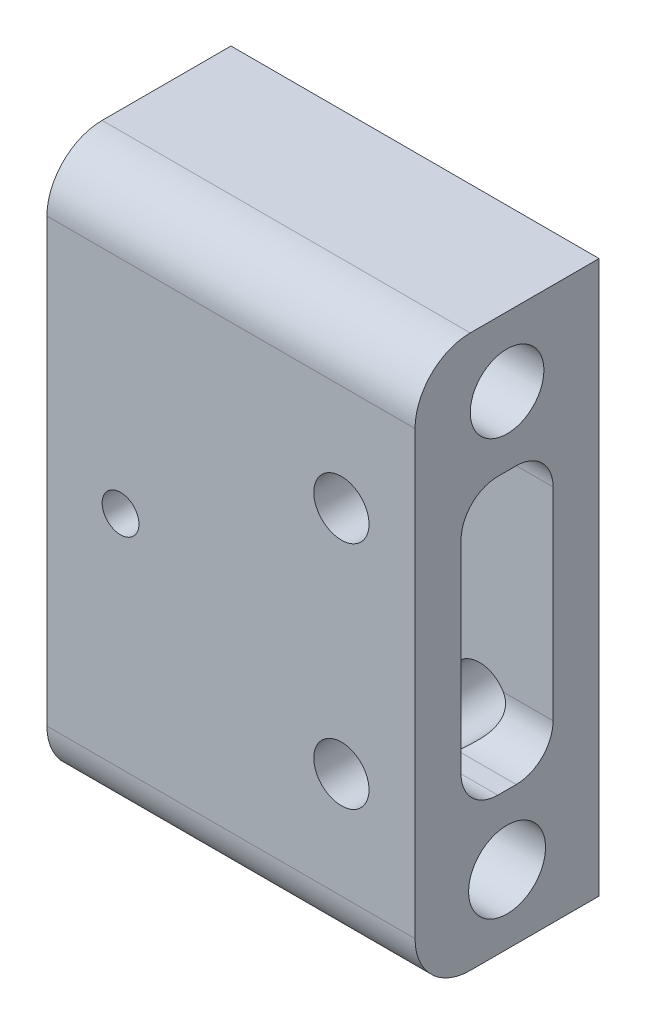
ISO-10303-21;
HEADER;
FILE_DESCRIPTION(('STEP AP214'),'2;1');
FILE_NAME('part.step','',(''),(''),'','','');
FILE_SCHEMA(('AUTOMOTIVE_DESIGN { 1 0 10303 214 1 1 1 1 }'));
ENDSEC;
DATA;
#1=APPLICATION_CONTEXT('core data for automotive mechanical design processes');
#2=APPLICATION_PROTOCOL_DEFINITION('international standard','automotive_design',2000,#1);
#3=PRODUCT_CONTEXT('',#1,'mechanical');
#4=PRODUCT('Part','Part','',(#3));
#5=PRODUCT_RELATED_PRODUCT_CATEGORY('part','',(#4));
#6=PRODUCT_DEFINITION_FORMATION('','',#4);
#7=PRODUCT_DEFINITION_CONTEXT('part definition',#1,'design');
#8=PRODUCT_DEFINITION('design','',#6,#7);
#9=PRODUCT_DEFINITION_SHAPE('','',#8);
#10=(LENGTH_UNIT() NAMED_UNIT(*) SI_UNIT(.MILLI.,.METRE.));
#11=(NAMED_UNIT(*) PLANE_ANGLE_UNIT() SI_UNIT($,.RADIAN.));
#12=(NAMED_UNIT(*) SI_UNIT($,.STERADIAN.) SOLID_ANGLE_UNIT());
#13=UNCERTAINTY_MEASURE_WITH_UNIT(LENGTH_MEASURE(1.E-05),#10,'distance_accuracy_value','');
#14=(GEOMETRIC_REPRESENTATION_CONTEXT(3) GLOBAL_UNCERTAINTY_ASSIGNED_CONTEXT((#13)) GLOBAL_UNIT_ASSIGNED_CONTEXT((#10,
#11,#12)) REPRESENTATION_CONTEXT('',''));
#15=CARTESIAN_POINT('',(0.,0.,0.));
#16=DIRECTION('',(0.,0.,1.));
#17=DIRECTION('',(1.,0.,0.));
#18=AXIS2_PLACEMENT_3D('',#15,#16,#17);
#19=CARTESIAN_POINT('',(40.,45.,5.));
#20=DIRECTION('',(0.,1.,0.));
#21=DIRECTION('',(0.,0.,1.));
#22=AXIS2_PLACEMENT_3D('',#19,#20,#21);
#23=PLANE('',#22);
#24=DIRECTION('',(-1.,0.,0.));
#25=VECTOR('',#24,1.);
#26=CARTESIAN_POINT('',(40.,45.,9.));
#27=LINE('',#26,#25);
#28=CARTESIAN_POINT('',(0.,45.,9.));
#29=VERTEX_POINT('',#28);
#30=CARTESIAN_POINT('',(30.3416876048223,45.,9.));
#31=VERTEX_POINT('',#30);
#32=EDGE_CURVE('E241',#29,#31,#27,.F.);
#33=ORIENTED_EDGE('',*,*,#32,.T.);
#34=DIRECTION('',(0.,0.,1.));
#35=VECTOR('',#34,1.);
#36=CARTESIAN_POINT('',(30.3416876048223,45.,0.));
#37=LINE('',#36,#35);
#38=CARTESIAN_POINT('',(30.3416876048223,45.,11.));
#39=VERTEX_POINT('',#38);
#40=EDGE_CURVE('E199',#31,#39,#37,.T.);
#41=ORIENTED_EDGE('',*,*,#40,.T.);
#42=DIRECTION('',(-1.,0.,0.));
#43=VECTOR('',#42,1.);
#44=CARTESIAN_POINT('',(0.,45.,11.));
#45=LINE('',#44,#43);
#46=CARTESIAN_POINT('',(0.,45.,11.));
#47=VERTEX_POINT('',#46);
#48=EDGE_CURVE('E243',#39,#47,#45,.T.);
#49=ORIENTED_EDGE('',*,*,#48,.T.);
#50=DIRECTION('',(0.,0.,-1.));
#51=VECTOR('',#50,1.);
#52=CARTESIAN_POINT('',(0.,45.,5.));
#53=LINE('',#52,#51);
#54=EDGE_CURVE('E366',#47,#29,#53,.T.);
#55=ORIENTED_EDGE('',*,*,#54,.T.);
#56=EDGE_LOOP('',(#33,#41,#49,#55));
#57=FACE_BOUND('',#56,.T.);
#58=ADVANCED_FACE('F45',(#57),#23,.F.);
#59=CARTESIAN_POINT('',(40.,15.,5.));
#60=DIRECTION('',(0.,-1.,0.));
#61=DIRECTION('',(0.,0.,-1.));
#62=AXIS2_PLACEMENT_3D('',#59,#60,#61);
#63=PLANE('',#62);
#64=DIRECTION('',(-1.,0.,0.));
#65=VECTOR('',#64,1.);
#66=CARTESIAN_POINT('',(0.,15.,9.));
#67=LINE('',#66,#65);
#68=CARTESIAN_POINT('',(40.,15.,9.));
#69=VERTEX_POINT('',#68);
#70=CARTESIAN_POINT('',(33.6583123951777,15.,9.));
#71=VERTEX_POINT('',#70);
#72=EDGE_CURVE('E221',#69,#71,#67,.T.);
#73=ORIENTED_EDGE('',*,*,#72,.T.);
#74=DIRECTION('',(0.,0.,1.));
#75=VECTOR('',#74,1.);
#76=CARTESIAN_POINT('',(33.6583123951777,15.,0.));
#77=LINE('',#76,#75);
#78=CARTESIAN_POINT('',(33.6583123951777,15.,11.));
#79=VERTEX_POINT('',#78);
#80=EDGE_CURVE('E323',#71,#79,#77,.T.);
#81=ORIENTED_EDGE('',*,*,#80,.T.);
#82=DIRECTION('',(-1.,0.,0.));
#83=VECTOR('',#82,1.);
#84=CARTESIAN_POINT('',(40.,15.,11.));
#85=LINE('',#84,#83);
#86=CARTESIAN_POINT('',(40.,15.,11.));
#87=VERTEX_POINT('',#86);
#88=EDGE_CURVE('E407',#79,#87,#85,.F.);
#89=ORIENTED_EDGE('',*,*,#88,.T.);
#90=DIRECTION('',(0.,0.,1.));
#91=VECTOR('',#90,1.);
#92=CARTESIAN_POINT('',(40.,15.,5.));
#93=LINE('',#92,#91);
#94=EDGE_CURVE('E365',#69,#87,#93,.T.);
#95=ORIENTED_EDGE('',*,*,#94,.F.);
#96=EDGE_LOOP('',(#73,#81,#89,#95));
#97=FACE_BOUND('',#96,.T.);
#98=ADVANCED_FACE('F416',(#97),#63,.F.);
#99=CARTESIAN_POINT('',(40.,19.,9.));
#100=DIRECTION('',(1.,0.,0.));
#101=DIRECTION('',(0.,0.,-1.));
#102=AXIS2_PLACEMENT_3D('',#99,#100,#101);
#103=CYLINDRICAL_SURFACE('',#102,4.);
#104=DIRECTION('',(-1.,0.,0.));
#105=VECTOR('',#104,1.);
#106=CARTESIAN_POINT('',(40.,19.,5.));
#107=LINE('',#106,#105);
#108=CARTESIAN_POINT('',(34.5980762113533,19.,5.));
#109=VERTEX_POINT('',#108);
#110=CARTESIAN_POINT('',(40.,19.,5.));
#111=VERTEX_POINT('',#110);
#112=EDGE_CURVE('E223',#109,#111,#107,.F.);
#113=ORIENTED_EDGE('',*,*,#112,.F.);
#114=CARTESIAN_POINT('',(34.5980762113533,19.,5.));
#115=CARTESIAN_POINT('',(34.6334442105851,18.9387641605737,4.99999051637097));
#116=CARTESIAN_POINT('',(34.6666314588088,18.8762583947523,5.00140614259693));
#117=CARTESIAN_POINT('',(34.7284699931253,18.7491711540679,5.00736760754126));
#118=CARTESIAN_POINT('',(34.757120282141,18.6845892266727,5.01191413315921));
#119=CARTESIAN_POINT('',(34.8096273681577,18.5540086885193,5.02440161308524));
#120=CARTESIAN_POINT('',(34.8334962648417,18.4880141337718,5.03233383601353));
#121=CARTESIAN_POINT('',(34.8764260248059,18.3550234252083,5.0517683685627));
#122=CARTESIAN_POINT('',(34.8954875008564,18.2880274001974,5.06327022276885));
#123=CARTESIAN_POINT('',(34.9454481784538,18.0860991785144,5.10339261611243));
#124=CARTESIAN_POINT('',(34.9690693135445,17.9503634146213,5.13761779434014));
#125=CARTESIAN_POINT('',(34.9975483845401,17.6816755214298,5.22086662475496));
#126=CARTESIAN_POINT('',(35.0024112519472,17.5487226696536,5.26988638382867));
#127=CARTESIAN_POINT('',(34.9953987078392,17.2891795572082,5.38156697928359));
#128=CARTESIAN_POINT('',(34.9835193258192,17.162590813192,5.44423104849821));
#129=CARTESIAN_POINT('',(34.9456657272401,16.9182983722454,5.58148973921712));
#130=CARTESIAN_POINT('',(34.9196777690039,16.8006034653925,5.65609594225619));
#131=CARTESIAN_POINT('',(34.8413622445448,16.5220484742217,5.8533963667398));
#132=CARTESIAN_POINT('',(34.7823857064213,16.3672900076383,5.98208270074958));
#133=CARTESIAN_POINT('',(34.6484767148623,16.0820760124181,6.25680082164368));
#134=CARTESIAN_POINT('',(34.5735161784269,15.9516640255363,6.40286293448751));
#135=CARTESIAN_POINT('',(34.4134682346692,15.7121713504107,6.71317953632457));
#136=CARTESIAN_POINT('',(34.328177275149,15.6036934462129,6.87779281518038));
#137=CARTESIAN_POINT('',(34.2004636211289,15.4598781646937,7.13527485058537));
#138=CARTESIAN_POINT('',(34.1579002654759,15.4150656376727,7.22292663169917));
#139=CARTESIAN_POINT('',(34.0742231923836,15.3318024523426,7.40185818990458));
#140=CARTESIAN_POINT('',(34.0331091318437,15.2933502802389,7.49313709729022));
#141=CARTESIAN_POINT('',(33.9334922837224,15.2047844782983,7.72753030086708));
#142=CARTESIAN_POINT('',(33.8769464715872,15.1588722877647,7.87311737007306));
#143=CARTESIAN_POINT('',(33.7788052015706,15.083451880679,8.17279261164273));
#144=CARTESIAN_POINT('',(33.7371264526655,15.0538517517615,8.32682766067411));
#145=CARTESIAN_POINT('',(33.6917513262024,15.0224264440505,8.56858752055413));
#146=CARTESIAN_POINT('',(33.6794051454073,15.0140861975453,8.65383918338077));
#147=CARTESIAN_POINT('',(33.6625981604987,15.0028411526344,8.82601455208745));
#148=CARTESIAN_POINT('',(33.6581889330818,14.9999718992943,8.91294551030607));
#149=CARTESIAN_POINT('',(33.6583123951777,15.,9.));
#150=B_SPLINE_CURVE_WITH_KNOTS('',3,(#114,#115,#116,#117,#118,#119,#120,#121,#122,#123,#124,
#125,#126,#127,#128,#129,#130,#131,#132,#133,#134,#135,#136,#137,#138,#139,#140,#141,#142,#143,
#144,#145,#146,#147,#148,#149),.UNSPECIFIED.,.F.,.F.,(4,2,2,2,2,2,2,2,2,2,2,2,2,2,2,2,2,4),(0.,
0.21210113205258,0.424248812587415,0.635852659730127,0.847429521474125,1.27101979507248,
1.69449870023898,2.11807805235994,2.54207071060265,3.16776933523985,3.79457647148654,
4.43678304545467,4.75833002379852,5.07980036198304,5.56692696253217,6.05127996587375,
6.31040139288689,6.57120067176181),.UNSPECIFIED.);
#151=EDGE_CURVE('E336',#109,#71,#150,.T.);
#152=ORIENTED_EDGE('',*,*,#151,.T.);
#153=ORIENTED_EDGE('',*,*,#72,.F.);
#154=CARTESIAN_POINT('',(40.,19.,9.));
#155=DIRECTION('',(-1.,0.,0.));
#156=DIRECTION('',(0.,0.,1.));
#157=AXIS2_PLACEMENT_3D('',#154,#155,#156);
#158=CIRCLE('',#157,4.);
#159=EDGE_CURVE('E249',#111,#69,#158,.T.);
#160=ORIENTED_EDGE('',*,*,#159,.F.);
#161=EDGE_LOOP('',(#113,#152,#153,#160));
#162=FACE_BOUND('',#161,.T.);
#163=ADVANCED_FACE('F331',(#162),#103,.F.);
#164=CARTESIAN_POINT('',(40.,19.,11.));
#165=DIRECTION('',(1.,0.,0.));
#166=DIRECTION('',(0.,0.,-1.));
#167=AXIS2_PLACEMENT_3D('',#164,#165,#166);
#168=CYLINDRICAL_SURFACE('',#167,4.);
#169=ORIENTED_EDGE('',*,*,#88,.F.);
#170=CARTESIAN_POINT('',(33.6583123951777,15.,11.));
#171=CARTESIAN_POINT('',(33.6581994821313,14.9999720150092,11.0835749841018));
#172=CARTESIAN_POINT('',(33.6622603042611,15.0026177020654,11.1670649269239));
#173=CARTESIAN_POINT('',(33.6778054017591,15.0130106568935,11.3327450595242));
#174=CARTESIAN_POINT('',(33.6892633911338,15.0207398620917,11.4149387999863));
#175=CARTESIAN_POINT('',(33.7184644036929,15.0409008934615,11.5762490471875));
#176=CARTESIAN_POINT('',(33.7361080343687,15.0532585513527,11.6553934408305));
#177=CARTESIAN_POINT('',(33.7764618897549,15.0823964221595,11.8116025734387));
#178=CARTESIAN_POINT('',(33.7991772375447,15.0991811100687,11.8886651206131));
#179=CARTESIAN_POINT('',(33.8584170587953,15.144543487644,12.0712326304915));
#180=CARTESIAN_POINT('',(33.8968095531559,15.1751447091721,12.1756255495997));
#181=CARTESIAN_POINT('',(33.9782324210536,15.2440202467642,12.3799448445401));
#182=CARTESIAN_POINT('',(34.0212642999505,15.282297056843,12.4798697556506));
#183=CARTESIAN_POINT('',(34.1100592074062,15.366592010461,12.6762621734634));
#184=CARTESIAN_POINT('',(34.1558417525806,15.4126711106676,12.7726945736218));
#185=CARTESIAN_POINT('',(34.2479855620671,15.5122454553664,12.9613641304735));
#186=CARTESIAN_POINT('',(34.2943468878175,15.5657414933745,13.0536008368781));
#187=CARTESIAN_POINT('',(34.3883449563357,15.6829375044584,13.2382158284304));
#188=CARTESIAN_POINT('',(34.4359352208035,15.7470054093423,13.3303859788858));
#189=CARTESIAN_POINT('',(34.5284833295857,15.883343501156,13.5098149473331));
#190=CARTESIAN_POINT('',(34.5734406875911,15.9556151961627,13.5970728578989));
#191=CARTESIAN_POINT('',(34.7017178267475,16.184284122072,13.8501156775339));
#192=CARTESIAN_POINT('',(34.7790107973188,16.3531985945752,14.0082270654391));
#193=CARTESIAN_POINT('',(34.8834284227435,16.6616196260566,14.2490881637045));
#194=CARTESIAN_POINT('',(34.9186910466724,16.7924013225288,14.3394766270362));
#195=CARTESIAN_POINT('',(34.9585019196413,16.9978647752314,14.4637956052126));
#196=CARTESIAN_POINT('',(34.9695922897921,17.0679107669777,14.5033623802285));
#197=CARTESIAN_POINT('',(34.9868862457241,17.210727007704,14.5784073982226));
#198=CARTESIAN_POINT('',(34.9930918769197,17.2834961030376,14.6138873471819));
#199=CARTESIAN_POINT('',(35.0001570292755,17.4319551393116,14.6807504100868));
#200=CARTESIAN_POINT('',(35.0009673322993,17.5076656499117,14.7120932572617));
#201=CARTESIAN_POINT('',(34.9966702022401,17.6606911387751,14.7700051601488));
#202=CARTESIAN_POINT('',(34.9915659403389,17.7380052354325,14.7965767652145));
#203=CARTESIAN_POINT('',(34.9751045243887,17.8935353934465,14.8447843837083));
#204=CARTESIAN_POINT('',(34.9637452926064,17.9717517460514,14.8664187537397));
#205=CARTESIAN_POINT('',(34.9345690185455,18.1281974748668,14.9046691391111));
#206=CARTESIAN_POINT('',(34.9167534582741,18.2064268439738,14.9212863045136));
#207=CARTESIAN_POINT('',(34.8789385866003,18.3460628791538,14.9466850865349));
#208=CARTESIAN_POINT('',(34.8601342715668,18.4076328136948,14.9563745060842));
#209=CARTESIAN_POINT('',(34.818458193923,18.5297849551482,14.9727439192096));
#210=CARTESIAN_POINT('',(34.7955868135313,18.5903672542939,14.9794241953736));
#211=CARTESIAN_POINT('',(34.7458398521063,18.7101958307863,14.9899414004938));
#212=CARTESIAN_POINT('',(34.7189596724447,18.769440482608,14.9937750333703));
#213=CARTESIAN_POINT('',(34.6613606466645,18.8861485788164,14.9988078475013));
#214=CARTESIAN_POINT('',(34.630641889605,18.9436120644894,15.0000070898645));
#215=CARTESIAN_POINT('',(34.5980762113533,19.,15.));
#216=B_SPLINE_CURVE_WITH_KNOTS('',3,(#170,#171,#172,#173,#174,#175,#176,#177,#178,#179,#180,
#181,#182,#183,#184,#185,#186,#187,#188,#189,#190,#191,#192,#193,#194,#195,#196,#197,#198,#199,
#200,#201,#202,#203,#204,#205,#206,#207,#208,#209,#210,#211,#212,#213,#214,#215),.UNSPECIFIED.,
.F.,.F.,(4,2,2,2,2,2,2,2,2,2,2,2,2,2,2,2,2,2,2,2,2,2,4),(0.,0.25044903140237,0.500012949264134,
0.745737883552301,0.991712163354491,1.3372411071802,1.68288250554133,2.03136066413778,
2.37987613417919,2.74521674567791,3.11062462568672,3.83737400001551,4.32398919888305,
4.56735994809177,4.81062873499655,5.05611370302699,5.3014671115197,5.54690206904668,
5.79228072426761,5.9873922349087,6.18248541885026,6.37780414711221,6.57311834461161),.UNSPECIFIED.);
#217=CARTESIAN_POINT('',(34.5980762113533,19.,15.));
#218=VERTEX_POINT('',#217);
#219=EDGE_CURVE('E428',#79,#218,#216,.T.);
#220=ORIENTED_EDGE('',*,*,#219,.T.);
#221=DIRECTION('',(-1.,0.,0.));
#222=VECTOR('',#221,1.);
#223=CARTESIAN_POINT('',(0.,19.,15.));
#224=LINE('',#223,#222);
#225=CARTESIAN_POINT('',(40.,19.,15.));
#226=VERTEX_POINT('',#225);
#227=EDGE_CURVE('E237',#226,#218,#224,.T.);
#228=ORIENTED_EDGE('',*,*,#227,.F.);
#229=CARTESIAN_POINT('',(40.,19.,11.));
#230=DIRECTION('',(-1.,0.,0.));
#231=DIRECTION('',(0.,0.,1.));
#232=AXIS2_PLACEMENT_3D('',#229,#230,#231);
#233=CIRCLE('',#232,4.);
#234=EDGE_CURVE('E253',#87,#226,#233,.T.);
#235=ORIENTED_EDGE('',*,*,#234,.F.);
#236=EDGE_LOOP('',(#169,#220,#228,#235));
#237=FACE_BOUND('',#236,.T.);
#238=ADVANCED_FACE('F427',(#237),#168,.F.);
#239=CARTESIAN_POINT('',(40.,41.,11.));
#240=DIRECTION('',(1.,0.,0.));
#241=DIRECTION('',(0.,0.,-1.));
#242=AXIS2_PLACEMENT_3D('',#239,#240,#241);
#243=CYLINDRICAL_SURFACE('',#242,4.);
#244=DIRECTION('',(-1.,0.,0.));
#245=VECTOR('',#244,1.);
#246=CARTESIAN_POINT('',(40.,41.,15.));
#247=LINE('',#246,#245);
#248=CARTESIAN_POINT('',(34.5980762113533,41.,15.));
#249=VERTEX_POINT('',#248);
#250=CARTESIAN_POINT('',(40.,41.,15.));
#251=VERTEX_POINT('',#250);
#252=EDGE_CURVE('E232',#249,#251,#247,.F.);
#253=ORIENTED_EDGE('',*,*,#252,.F.);
#254=CARTESIAN_POINT('',(34.5980762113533,41.,15.));
#255=CARTESIAN_POINT('',(34.6334442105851,41.0612358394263,15.000009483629));
#256=CARTESIAN_POINT('',(34.6666314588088,41.1237416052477,14.9985938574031));
#257=CARTESIAN_POINT('',(34.7284699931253,41.2508288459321,14.9926323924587));
#258=CARTESIAN_POINT('',(34.757120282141,41.3154107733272,14.9880858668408));
#259=CARTESIAN_POINT('',(34.8096273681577,41.4459913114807,14.9755983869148));
#260=CARTESIAN_POINT('',(34.8334962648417,41.5119858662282,14.9676661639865));
#261=CARTESIAN_POINT('',(34.8764260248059,41.6449765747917,14.9482316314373));
#262=CARTESIAN_POINT('',(34.8954875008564,41.7119725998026,14.9367297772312));
#263=CARTESIAN_POINT('',(34.9454481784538,41.9139008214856,14.8966073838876));
#264=CARTESIAN_POINT('',(34.9690693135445,42.0496365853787,14.8623822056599));
#265=CARTESIAN_POINT('',(34.9975483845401,42.3183244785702,14.779133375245));
#266=CARTESIAN_POINT('',(35.0024112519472,42.4512773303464,14.7301136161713));
#267=CARTESIAN_POINT('',(34.9953987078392,42.7108204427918,14.6184330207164));
#268=CARTESIAN_POINT('',(34.9835193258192,42.837409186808,14.5557689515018));
#269=CARTESIAN_POINT('',(34.9456657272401,43.0817016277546,14.4185102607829));
#270=CARTESIAN_POINT('',(34.9196777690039,43.1993965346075,14.3439040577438));
#271=CARTESIAN_POINT('',(34.8413622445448,43.4779515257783,14.1466036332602));
#272=CARTESIAN_POINT('',(34.7823857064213,43.6327099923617,14.0179172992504));
#273=CARTESIAN_POINT('',(34.6484767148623,43.9179239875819,13.7431991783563));
#274=CARTESIAN_POINT('',(34.5735161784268,44.0483359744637,13.5971370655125));
#275=CARTESIAN_POINT('',(34.4134682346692,44.2878286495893,13.2868204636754));
#276=CARTESIAN_POINT('',(34.328177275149,44.3963065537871,13.1222071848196));
#277=CARTESIAN_POINT('',(34.2004636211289,44.5401218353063,12.8647251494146));
#278=CARTESIAN_POINT('',(34.1579002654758,44.5849343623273,12.7770733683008));
#279=CARTESIAN_POINT('',(34.0742231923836,44.6681975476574,12.5981418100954));
#280=CARTESIAN_POINT('',(34.0331091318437,44.7066497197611,12.5068629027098));
#281=CARTESIAN_POINT('',(33.9334922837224,44.7952155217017,12.2724696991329));
#282=CARTESIAN_POINT('',(33.8769464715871,44.8411277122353,12.1268826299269));
#283=CARTESIAN_POINT('',(33.7788052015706,44.916548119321,11.8272073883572));
#284=CARTESIAN_POINT('',(33.7371264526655,44.9461482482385,11.6731723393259));
#285=CARTESIAN_POINT('',(33.6917513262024,44.9775735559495,11.4314124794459));
#286=CARTESIAN_POINT('',(33.6794051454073,44.9859138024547,11.3461608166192));
#287=CARTESIAN_POINT('',(33.6625981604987,44.9971588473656,11.1739854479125));
#288=CARTESIAN_POINT('',(33.6581889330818,45.0000281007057,11.0870544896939));
#289=CARTESIAN_POINT('',(33.6583123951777,45.,11.));
#290=B_SPLINE_CURVE_WITH_KNOTS('',3,(#254,#255,#256,#257,#258,#259,#260,#261,#262,#263,#264,
#265,#266,#267,#268,#269,#270,#271,#272,#273,#274,#275,#276,#277,#278,#279,#280,#281,#282,#283,
#284,#285,#286,#287,#288,#289),.UNSPECIFIED.,.F.,.F.,(4,2,2,2,2,2,2,2,2,2,2,2,2,2,2,2,2,4),(0.,
0.212101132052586,0.424248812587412,0.635852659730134,0.847429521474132,1.27101979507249,
1.694498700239,2.11807805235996,2.54207071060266,3.16776933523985,3.79457647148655,
4.43678304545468,4.75833002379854,5.07980036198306,5.56692696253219,6.05127996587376,
6.31040139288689,6.57120067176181),.UNSPECIFIED.);
#291=CARTESIAN_POINT('',(33.6583123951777,45.,11.));
#292=VERTEX_POINT('',#291);
#293=EDGE_CURVE('E304',#249,#292,#290,.T.);
#294=ORIENTED_EDGE('',*,*,#293,.T.);
#295=CARTESIAN_POINT('',(40.,45.,11.));
#296=VERTEX_POINT('',#295);
#297=EDGE_CURVE('E244',#296,#292,#45,.T.);
#298=ORIENTED_EDGE('',*,*,#297,.F.);
#299=CARTESIAN_POINT('',(40.,41.,11.));
#300=DIRECTION('',(-1.,0.,0.));
#301=DIRECTION('',(0.,0.,1.));
#302=AXIS2_PLACEMENT_3D('',#299,#300,#301);
#303=CIRCLE('',#302,4.);
#304=EDGE_CURVE('E257',#251,#296,#303,.T.);
#305=ORIENTED_EDGE('',*,*,#304,.F.);
#306=EDGE_LOOP('',(#253,#294,#298,#305));
#307=FACE_BOUND('',#306,.T.);
#308=ADVANCED_FACE('F300',(#307),#243,.F.);
#309=CARTESIAN_POINT('',(40.,41.,9.));
#310=DIRECTION('',(1.,0.,0.));
#311=DIRECTION('',(0.,0.,-1.));
#312=AXIS2_PLACEMENT_3D('',#309,#310,#311);
#313=CYLINDRICAL_SURFACE('',#312,4.);
#314=CARTESIAN_POINT('',(33.6583123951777,45.,9.));
#315=VERTEX_POINT('',#314);
#316=CARTESIAN_POINT('',(40.,45.,9.));
#317=VERTEX_POINT('',#316);
#318=EDGE_CURVE('E240',#315,#317,#27,.F.);
#319=ORIENTED_EDGE('',*,*,#318,.F.);
#320=CARTESIAN_POINT('',(33.6583123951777,45.,9.));
#321=CARTESIAN_POINT('',(33.6581994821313,45.0000279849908,8.91642501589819));
#322=CARTESIAN_POINT('',(33.6622603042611,44.9973822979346,8.83293507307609));
#323=CARTESIAN_POINT('',(33.6778054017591,44.9869893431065,8.66725494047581));
#324=CARTESIAN_POINT('',(33.6892633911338,44.9792601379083,8.58506120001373));
#325=CARTESIAN_POINT('',(33.7184644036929,44.9590991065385,8.42375095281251));
#326=CARTESIAN_POINT('',(33.7361080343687,44.9467414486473,8.34460655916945));
#327=CARTESIAN_POINT('',(33.7764618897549,44.9176035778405,8.1883974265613));
#328=CARTESIAN_POINT('',(33.7991772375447,44.9008188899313,8.11133487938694));
#329=CARTESIAN_POINT('',(33.8584170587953,44.855456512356,7.92876736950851));
#330=CARTESIAN_POINT('',(33.8968095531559,44.8248552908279,7.82437445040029));
#331=CARTESIAN_POINT('',(33.9782324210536,44.7559797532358,7.62005515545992));
#332=CARTESIAN_POINT('',(34.0212642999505,44.717702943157,7.52013024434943));
#333=CARTESIAN_POINT('',(34.1100592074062,44.633407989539,7.32373782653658));
#334=CARTESIAN_POINT('',(34.1558417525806,44.5873288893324,7.22730542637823));
#335=CARTESIAN_POINT('',(34.2479855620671,44.4877545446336,7.03863586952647));
#336=CARTESIAN_POINT('',(34.2943468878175,44.4342585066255,6.94639916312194));
#337=CARTESIAN_POINT('',(34.3883449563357,44.3170624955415,6.76178417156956));
#338=CARTESIAN_POINT('',(34.4359352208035,44.2529945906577,6.66961402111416));
#339=CARTESIAN_POINT('',(34.5284833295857,44.116656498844,6.49018505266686));
#340=CARTESIAN_POINT('',(34.5734406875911,44.0443848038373,6.4029271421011));
#341=CARTESIAN_POINT('',(34.7017178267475,43.815715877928,6.14988432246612));
#342=CARTESIAN_POINT('',(34.7790107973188,43.6468014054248,5.99177293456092));
#343=CARTESIAN_POINT('',(34.8834284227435,43.3383803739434,5.75091183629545));
#344=CARTESIAN_POINT('',(34.9186910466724,43.2075986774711,5.6605233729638));
#345=CARTESIAN_POINT('',(34.9585019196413,43.0021352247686,5.53620439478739));
#346=CARTESIAN_POINT('',(34.9695922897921,42.9320892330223,5.49663761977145));
#347=CARTESIAN_POINT('',(34.9868862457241,42.789272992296,5.42159260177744));
#348=CARTESIAN_POINT('',(34.9930918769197,42.7165038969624,5.38611265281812));
#349=CARTESIAN_POINT('',(35.0001570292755,42.5680448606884,5.3192495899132));
#350=CARTESIAN_POINT('',(35.0009673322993,42.4923343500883,5.28790674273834));
#351=CARTESIAN_POINT('',(34.9966702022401,42.3393088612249,5.22999483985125));
#352=CARTESIAN_POINT('',(34.9915659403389,42.2619947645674,5.20342323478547));
#353=CARTESIAN_POINT('',(34.9751045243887,42.1064646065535,5.15521561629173));
#354=CARTESIAN_POINT('',(34.9637452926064,42.0282482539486,5.13358124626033));
#355=CARTESIAN_POINT('',(34.9345690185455,41.8718025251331,5.09533086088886));
#356=CARTESIAN_POINT('',(34.9167534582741,41.7935731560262,5.07871369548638));
#357=CARTESIAN_POINT('',(34.8789385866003,41.6539371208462,5.05331491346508));
#358=CARTESIAN_POINT('',(34.8601342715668,41.5923671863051,5.04362549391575));
#359=CARTESIAN_POINT('',(34.818458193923,41.4702150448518,5.02725608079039));
#360=CARTESIAN_POINT('',(34.7955868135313,41.4096327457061,5.02057580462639));
#361=CARTESIAN_POINT('',(34.7458398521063,41.2898041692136,5.01005859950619));
#362=CARTESIAN_POINT('',(34.7189596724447,41.2305595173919,5.0062249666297));
#363=CARTESIAN_POINT('',(34.6613606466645,41.1138514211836,5.0011921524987));
#364=CARTESIAN_POINT('',(34.630641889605,41.0563879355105,4.99999291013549));
#365=CARTESIAN_POINT('',(34.5980762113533,41.,5.));
#366=B_SPLINE_CURVE_WITH_KNOTS('',3,(#320,#321,#322,#323,#324,#325,#326,#327,#328,#329,#330,
#331,#332,#333,#334,#335,#336,#337,#338,#339,#340,#341,#342,#343,#344,#345,#346,#347,#348,#349,
#350,#351,#352,#353,#354,#355,#356,#357,#358,#359,#360,#361,#362,#363,#364,#365),.UNSPECIFIED.,
.F.,.F.,(4,2,2,2,2,2,2,2,2,2,2,2,2,2,2,2,2,2,2,2,2,2,4),(0.,0.250449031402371,0.500012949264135,
0.745737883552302,0.991712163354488,1.3372411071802,1.68288250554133,2.03136066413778,
2.37987613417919,2.74521674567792,3.11062462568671,3.83737400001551,4.32398919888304,
4.56735994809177,4.81062873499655,5.056113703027,5.30146711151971,5.54690206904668,
5.79228072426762,5.9873922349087,6.18248541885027,6.37780414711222,6.57311834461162),.UNSPECIFIED.);
#367=CARTESIAN_POINT('',(34.5980762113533,41.,5.));
#368=VERTEX_POINT('',#367);
#369=EDGE_CURVE('E204',#315,#368,#366,.T.);
#370=ORIENTED_EDGE('',*,*,#369,.T.);
#371=DIRECTION('',(-1.,0.,0.));
#372=VECTOR('',#371,1.);
#373=CARTESIAN_POINT('',(0.,41.,5.));
#374=LINE('',#373,#372);
#375=CARTESIAN_POINT('',(40.,41.,5.));
#376=VERTEX_POINT('',#375);
#377=EDGE_CURVE('E215',#376,#368,#374,.T.);
#378=ORIENTED_EDGE('',*,*,#377,.F.);
#379=CARTESIAN_POINT('',(40.,41.,9.));
#380=DIRECTION('',(-1.,0.,0.));
#381=DIRECTION('',(0.,0.,1.));
#382=AXIS2_PLACEMENT_3D('',#379,#380,#381);
#383=CIRCLE('',#382,4.);
#384=EDGE_CURVE('E205',#317,#376,#383,.T.);
#385=ORIENTED_EDGE('',*,*,#384,.F.);
#386=EDGE_LOOP('',(#319,#370,#378,#385));
#387=FACE_BOUND('',#386,.T.);
#388=ADVANCED_FACE('F444',(#387),#313,.F.);
#389=CARTESIAN_POINT('',(0.,0.,20.));
#390=DIRECTION('',(1.,0.,0.));
#391=DIRECTION('',(0.,0.,-1.));
#392=AXIS2_PLACEMENT_3D('',#389,#390,#391);
#393=PLANE('',#392);
#394=CARTESIAN_POINT('',(0.,52.5,9.99999999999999));
#395=DIRECTION('',(-1.,0.,0.));
#396=DIRECTION('',(0.,0.,1.));
#397=AXIS2_PLACEMENT_3D('',#394,#395,#396);
#398=CIRCLE('',#397,4.00000000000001);
#399=CARTESIAN_POINT('',(0.,52.5,14.));
#400=VERTEX_POINT('',#399);
#401=EDGE_CURVE('E352',#400,#400,#398,.T.);
#402=ORIENTED_EDGE('',*,*,#401,.F.);
#403=EDGE_LOOP('',(#402));
#404=FACE_BOUND('',#403,.T.);
#405=CARTESIAN_POINT('',(0.,7.5,10.));
#406=DIRECTION('',(-1.,0.,0.));
#407=DIRECTION('',(0.,0.,1.));
#408=AXIS2_PLACEMENT_3D('',#405,#406,#407);
#409=CIRCLE('',#408,4.17887643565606);
#410=CARTESIAN_POINT('',(0.,7.5,14.1788764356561));
#411=VERTEX_POINT('',#410);
#412=EDGE_CURVE('E358',#411,#411,#409,.T.);
#413=ORIENTED_EDGE('',*,*,#412,.F.);
#414=EDGE_LOOP('',(#413));
#415=FACE_BOUND('',#414,.T.);
#416=DIRECTION('',(0.,0.,1.));
#417=VECTOR('',#416,1.);
#418=CARTESIAN_POINT('',(0.,15.,5.));
#419=LINE('',#418,#417);
#420=CARTESIAN_POINT('',(0.,15.,9.));
#421=VERTEX_POINT('',#420);
#422=CARTESIAN_POINT('',(0.,15.,11.));
#423=VERTEX_POINT('',#422);
#424=EDGE_CURVE('E375',#421,#423,#419,.T.);
#425=ORIENTED_EDGE('',*,*,#424,.F.);
#426=CARTESIAN_POINT('',(0.,19.,9.));
#427=DIRECTION('',(1.,0.,0.));
#428=DIRECTION('',(0.,0.,-1.));
#429=AXIS2_PLACEMENT_3D('',#426,#427,#428);
#430=CIRCLE('',#429,4.);
#431=CARTESIAN_POINT('',(0.,19.,5.));
#432=VERTEX_POINT('',#431);
#433=EDGE_CURVE('E247',#421,#432,#430,.T.);
#434=ORIENTED_EDGE('',*,*,#433,.T.);
#435=DIRECTION('',(0.,-1.,0.));
#436=VECTOR('',#435,1.);
#437=CARTESIAN_POINT('',(0.,45.,5.));
#438=LINE('',#437,#436);
#439=CARTESIAN_POINT('',(0.,41.,5.));
#440=VERTEX_POINT('',#439);
#441=EDGE_CURVE('E347',#440,#432,#438,.T.);
#442=ORIENTED_EDGE('',*,*,#441,.F.);
#443=CARTESIAN_POINT('',(0.,41.,9.));
#444=DIRECTION('',(1.,0.,0.));
#445=DIRECTION('',(0.,0.,-1.));
#446=AXIS2_PLACEMENT_3D('',#443,#444,#445);
#447=CIRCLE('',#446,4.);
#448=EDGE_CURVE('E219',#440,#29,#447,.T.);
#449=ORIENTED_EDGE('',*,*,#448,.T.);
#450=ORIENTED_EDGE('',*,*,#54,.F.);
#451=CARTESIAN_POINT('',(0.,41.,11.));
#452=DIRECTION('',(1.,0.,0.));
#453=DIRECTION('',(0.,0.,-1.));
#454=AXIS2_PLACEMENT_3D('',#451,#452,#453);
#455=CIRCLE('',#454,4.);
#456=CARTESIAN_POINT('',(0.,41.,15.));
#457=VERTEX_POINT('',#456);
#458=EDGE_CURVE('E255',#47,#457,#455,.T.);
#459=ORIENTED_EDGE('',*,*,#458,.T.);
#460=DIRECTION('',(0.,1.,0.));
#461=VECTOR('',#460,1.);
#462=CARTESIAN_POINT('',(0.,45.,15.));
#463=LINE('',#462,#461);
#464=CARTESIAN_POINT('',(0.,19.,15.));
#465=VERTEX_POINT('',#464);
#466=EDGE_CURVE('E378',#465,#457,#463,.T.);
#467=ORIENTED_EDGE('',*,*,#466,.F.);
#468=CARTESIAN_POINT('',(0.,19.,11.));
#469=DIRECTION('',(1.,0.,0.));
#470=DIRECTION('',(0.,0.,-1.));
#471=AXIS2_PLACEMENT_3D('',#468,#469,#470);
#472=CIRCLE('',#471,4.);
#473=EDGE_CURVE('E251',#465,#423,#472,.T.);
#474=ORIENTED_EDGE('',*,*,#473,.T.);
#475=EDGE_LOOP('',(#425,#434,#442,#449,#450,#459,#467,#474));
#476=FACE_BOUND('',#475,.T.);
#477=DIRECTION('',(0.,0.,-1.));
#478=VECTOR('',#477,1.);
#479=CARTESIAN_POINT('',(0.,0.,20.));
#480=LINE('',#479,#478);
#481=CARTESIAN_POINT('',(0.,0.,14.));
#482=VERTEX_POINT('',#481);
#483=CARTESIAN_POINT('',(0.,0.,0.));
#484=VERTEX_POINT('',#483);
#485=EDGE_CURVE('E406',#482,#484,#480,.T.);
#486=ORIENTED_EDGE('',*,*,#485,.F.);
#487=CARTESIAN_POINT('',(0.,6.,14.));
#488=DIRECTION('',(1.,0.,0.));
#489=DIRECTION('',(0.,0.,-1.));
#490=AXIS2_PLACEMENT_3D('',#487,#488,#489);
#491=CIRCLE('',#490,6.);
#492=CARTESIAN_POINT('',(0.,6.,20.));
#493=VERTEX_POINT('',#492);
#494=EDGE_CURVE('E53',#482,#493,#491,.F.);
#495=ORIENTED_EDGE('',*,*,#494,.T.);
#496=DIRECTION('',(0.,-1.,0.));
#497=VECTOR('',#496,1.);
#498=CARTESIAN_POINT('',(0.,0.,20.));
#499=LINE('',#498,#497);
#500=CARTESIAN_POINT('',(0.,54.,20.));
#501=VERTEX_POINT('',#500);
#502=EDGE_CURVE('E383',#501,#493,#499,.T.);
#503=ORIENTED_EDGE('',*,*,#502,.F.);
#504=CARTESIAN_POINT('',(0.,54.,14.));
#505=DIRECTION('',(1.,0.,0.));
#506=DIRECTION('',(0.,0.,-1.));
#507=AXIS2_PLACEMENT_3D('',#504,#505,#506);
#508=CIRCLE('',#507,6.);
#509=CARTESIAN_POINT('',(0.,60.,14.));
#510=VERTEX_POINT('',#509);
#511=EDGE_CURVE('E60',#501,#510,#508,.F.);
#512=ORIENTED_EDGE('',*,*,#511,.T.);
#513=DIRECTION('',(0.,0.,-1.));
#514=VECTOR('',#513,1.);
#515=CARTESIAN_POINT('',(0.,60.,20.));
#516=LINE('',#515,#514);
#517=CARTESIAN_POINT('',(0.,60.,0.));
#518=VERTEX_POINT('',#517);
#519=EDGE_CURVE('E390',#510,#518,#516,.T.);
#520=ORIENTED_EDGE('',*,*,#519,.T.);
#521=DIRECTION('',(0.,-1.,0.));
#522=VECTOR('',#521,1.);
#523=CARTESIAN_POINT('',(0.,0.,0.));
#524=LINE('',#523,#522);
#525=EDGE_CURVE('E351',#518,#484,#524,.T.);
#526=ORIENTED_EDGE('',*,*,#525,.T.);
#527=EDGE_LOOP('',(#486,#495,#503,#512,#520,#526));
#528=FACE_BOUND('',#527,.T.);
#529=ADVANCED_FACE('F332',(#404,#415,#476,#528),#393,.F.);
#530=CARTESIAN_POINT('',(0.,0.,20.));
#531=DIRECTION('',(0.,1.,0.));
#532=DIRECTION('',(0.,0.,1.));
#533=AXIS2_PLACEMENT_3D('',#530,#531,#532);
#534=PLANE('',#533);
#535=DIRECTION('',(0.,0.,-1.));
#536=VECTOR('',#535,1.);
#537=CARTESIAN_POINT('',(40.,0.,20.));
#538=LINE('',#537,#536);
#539=CARTESIAN_POINT('',(40.,0.,14.));
#540=VERTEX_POINT('',#539);
#541=CARTESIAN_POINT('',(40.,0.,0.));
#542=VERTEX_POINT('',#541);
#543=EDGE_CURVE('E404',#540,#542,#538,.T.);
#544=ORIENTED_EDGE('',*,*,#543,.F.);
#545=DIRECTION('',(1.,0.,0.));
#546=VECTOR('',#545,1.);
#547=CARTESIAN_POINT('',(0.,0.,14.));
#548=LINE('',#547,#546);
#549=EDGE_CURVE('E68',#540,#482,#548,.F.);
#550=ORIENTED_EDGE('',*,*,#549,.T.);
#551=ORIENTED_EDGE('',*,*,#485,.T.);
#552=DIRECTION('',(1.,0.,0.));
#553=VECTOR('',#552,1.);
#554=CARTESIAN_POINT('',(0.,0.,0.));
#555=LINE('',#554,#553);
#556=EDGE_CURVE('E393',#484,#542,#555,.T.);
#557=ORIENTED_EDGE('',*,*,#556,.T.);
#558=EDGE_LOOP('',(#544,#550,#551,#557));
#559=FACE_BOUND('',#558,.T.);
#560=ADVANCED_FACE('F477',(#559),#534,.F.);
#561=CARTESIAN_POINT('',(40.,0.,20.));
#562=DIRECTION('',(-1.,0.,0.));
#563=DIRECTION('',(0.,0.,1.));
#564=AXIS2_PLACEMENT_3D('',#561,#562,#563);
#565=PLANE('',#564);
#566=CARTESIAN_POINT('',(40.,52.5,9.99999999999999));
#567=DIRECTION('',(-1.,0.,0.));
#568=DIRECTION('',(0.,0.,1.));
#569=AXIS2_PLACEMENT_3D('',#566,#567,#568);
#570=CIRCLE('',#569,4.00000000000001);
#571=CARTESIAN_POINT('',(40.,52.5,14.));
#572=VERTEX_POINT('',#571);
#573=EDGE_CURVE('E348',#572,#572,#570,.T.);
#574=ORIENTED_EDGE('',*,*,#573,.T.);
#575=EDGE_LOOP('',(#574));
#576=FACE_BOUND('',#575,.T.);
#577=CARTESIAN_POINT('',(40.,7.5,10.));
#578=DIRECTION('',(-1.,0.,0.));
#579=DIRECTION('',(0.,0.,1.));
#580=AXIS2_PLACEMENT_3D('',#577,#578,#579);
#581=CIRCLE('',#580,4.17887643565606);
#582=CARTESIAN_POINT('',(40.,7.5,14.1788764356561));
#583=VERTEX_POINT('',#582);
#584=EDGE_CURVE('E355',#583,#583,#581,.T.);
#585=ORIENTED_EDGE('',*,*,#584,.T.);
#586=EDGE_LOOP('',(#585));
#587=FACE_BOUND('',#586,.T.);
#588=DIRECTION('',(0.,1.,0.));
#589=VECTOR('',#588,1.);
#590=CARTESIAN_POINT('',(40.,45.,15.));
#591=LINE('',#590,#589);
#592=EDGE_CURVE('E369',#226,#251,#591,.T.);
#593=ORIENTED_EDGE('',*,*,#592,.T.);
#594=ORIENTED_EDGE('',*,*,#304,.T.);
#595=DIRECTION('',(0.,0.,-1.));
#596=VECTOR('',#595,1.);
#597=CARTESIAN_POINT('',(40.,45.,5.));
#598=LINE('',#597,#596);
#599=EDGE_CURVE('E361',#296,#317,#598,.T.);
#600=ORIENTED_EDGE('',*,*,#599,.T.);
#601=ORIENTED_EDGE('',*,*,#384,.T.);
#602=DIRECTION('',(0.,-1.,0.));
#603=VECTOR('',#602,1.);
#604=CARTESIAN_POINT('',(40.,45.,5.));
#605=LINE('',#604,#603);
#606=EDGE_CURVE('E362',#376,#111,#605,.T.);
#607=ORIENTED_EDGE('',*,*,#606,.T.);
#608=ORIENTED_EDGE('',*,*,#159,.T.);
#609=ORIENTED_EDGE('',*,*,#94,.T.);
#610=ORIENTED_EDGE('',*,*,#234,.T.);
#611=EDGE_LOOP('',(#593,#594,#600,#601,#607,#608,#609,#610));
#612=FACE_BOUND('',#611,.T.);
#613=DIRECTION('',(0.,1.,0.));
#614=VECTOR('',#613,1.);
#615=CARTESIAN_POINT('',(40.,0.,20.));
#616=LINE('',#615,#614);
#617=CARTESIAN_POINT('',(40.,6.,20.));
#618=VERTEX_POINT('',#617);
#619=CARTESIAN_POINT('',(40.,54.,20.));
#620=VERTEX_POINT('',#619);
#621=EDGE_CURVE('E386',#618,#620,#616,.T.);
#622=ORIENTED_EDGE('',*,*,#621,.F.);
#623=CARTESIAN_POINT('',(40.,6.,14.));
#624=DIRECTION('',(-1.,0.,0.));
#625=DIRECTION('',(0.,0.,1.));
#626=AXIS2_PLACEMENT_3D('',#623,#624,#625);
#627=CIRCLE('',#626,6.);
#628=EDGE_CURVE('E466',#618,#540,#627,.F.);
#629=ORIENTED_EDGE('',*,*,#628,.T.);
#630=ORIENTED_EDGE('',*,*,#543,.T.);
#631=DIRECTION('',(0.,1.,0.));
#632=VECTOR('',#631,1.);
#633=CARTESIAN_POINT('',(40.,0.,0.));
#634=LINE('',#633,#632);
#635=CARTESIAN_POINT('',(40.,60.,0.));
#636=VERTEX_POINT('',#635);
#637=EDGE_CURVE('E396',#542,#636,#634,.T.);
#638=ORIENTED_EDGE('',*,*,#637,.T.);
#639=DIRECTION('',(0.,0.,-1.));
#640=VECTOR('',#639,1.);
#641=CARTESIAN_POINT('',(40.,60.,20.));
#642=LINE('',#641,#640);
#643=CARTESIAN_POINT('',(40.,60.,14.));
#644=VERTEX_POINT('',#643);
#645=EDGE_CURVE('E402',#644,#636,#642,.T.);
#646=ORIENTED_EDGE('',*,*,#645,.F.);
#647=CARTESIAN_POINT('',(40.,54.,14.));
#648=DIRECTION('',(-1.,0.,0.));
#649=DIRECTION('',(0.,0.,1.));
#650=AXIS2_PLACEMENT_3D('',#647,#648,#649);
#651=CIRCLE('',#650,6.);
#652=EDGE_CURVE('E464',#644,#620,#651,.F.);
#653=ORIENTED_EDGE('',*,*,#652,.T.);
#654=EDGE_LOOP('',(#622,#629,#630,#638,#646,#653));
#655=FACE_BOUND('',#654,.T.);
#656=ADVANCED_FACE('F422',(#576,#587,#612,#655),#565,.F.);
#657=CARTESIAN_POINT('',(0.,60.,20.));
#658=DIRECTION('',(0.,-1.,0.));
#659=DIRECTION('',(0.,0.,-1.));
#660=AXIS2_PLACEMENT_3D('',#657,#658,#659);
#661=PLANE('',#660);
#662=ORIENTED_EDGE('',*,*,#519,.F.);
#663=DIRECTION('',(-1.,0.,0.));
#664=VECTOR('',#663,1.);
#665=CARTESIAN_POINT('',(0.,60.,14.));
#666=LINE('',#665,#664);
#667=EDGE_CURVE('E13',#510,#644,#666,.F.);
#668=ORIENTED_EDGE('',*,*,#667,.T.);
#669=ORIENTED_EDGE('',*,*,#645,.T.);
#670=DIRECTION('',(-1.,0.,0.));
#671=VECTOR('',#670,1.);
#672=CARTESIAN_POINT('',(0.,60.,0.));
#673=LINE('',#672,#671);
#674=EDGE_CURVE('E387',#636,#518,#673,.T.);
#675=ORIENTED_EDGE('',*,*,#674,.T.);
#676=EDGE_LOOP('',(#662,#668,#669,#675));
#677=FACE_BOUND('',#676,.T.);
#678=ADVANCED_FACE('F489',(#677),#661,.F.);
#679=CARTESIAN_POINT('',(0.,0.,20.));
#680=DIRECTION('',(0.,0.,-1.));
#681=DIRECTION('',(-1.,0.,0.));
#682=AXIS2_PLACEMENT_3D('',#679,#680,#681);
#683=PLANE('',#682);
#684=CARTESIAN_POINT('',(8.,30.,20.));
#685=DIRECTION('',(0.,0.,1.));
#686=DIRECTION('',(1.,0.,0.));
#687=AXIS2_PLACEMENT_3D('',#684,#685,#686);
#688=CIRCLE('',#687,2.);
#689=CARTESIAN_POINT('',(10.,30.,20.));
#690=VERTEX_POINT('',#689);
#691=EDGE_CURVE('E551',#690,#690,#688,.T.);
#692=ORIENTED_EDGE('',*,*,#691,.F.);
#693=EDGE_LOOP('',(#692));
#694=FACE_BOUND('',#693,.T.);
#695=CARTESIAN_POINT('',(32.,42.5,20.));
#696=DIRECTION('',(0.,0.,1.));
#697=DIRECTION('',(1.,0.,0.));
#698=AXIS2_PLACEMENT_3D('',#695,#696,#697);
#699=CIRCLE('',#698,3.);
#700=CARTESIAN_POINT('',(35.,42.5,20.));
#701=VERTEX_POINT('',#700);
#702=EDGE_CURVE('E560',#701,#701,#699,.T.);
#703=ORIENTED_EDGE('',*,*,#702,.F.);
#704=EDGE_LOOP('',(#703));
#705=FACE_BOUND('',#704,.T.);
#706=CARTESIAN_POINT('',(32.,17.5,20.));
#707=DIRECTION('',(0.,0.,1.));
#708=DIRECTION('',(1.,0.,0.));
#709=AXIS2_PLACEMENT_3D('',#706,#707,#708);
#710=CIRCLE('',#709,3.);
#711=CARTESIAN_POINT('',(35.,17.5,20.));
#712=VERTEX_POINT('',#711);
#713=EDGE_CURVE('E554',#712,#712,#710,.T.);
#714=ORIENTED_EDGE('',*,*,#713,.F.);
#715=EDGE_LOOP('',(#714));
#716=FACE_BOUND('',#715,.T.);
#717=ORIENTED_EDGE('',*,*,#502,.T.);
#718=DIRECTION('',(1.,0.,0.));
#719=VECTOR('',#718,1.);
#720=CARTESIAN_POINT('',(0.,6.,20.));
#721=LINE('',#720,#719);
#722=EDGE_CURVE('E461',#493,#618,#721,.T.);
#723=ORIENTED_EDGE('',*,*,#722,.T.);
#724=ORIENTED_EDGE('',*,*,#621,.T.);
#725=DIRECTION('',(-1.,0.,0.));
#726=VECTOR('',#725,1.);
#727=CARTESIAN_POINT('',(0.,54.,20.));
#728=LINE('',#727,#726);
#729=EDGE_CURVE('E448',#620,#501,#728,.T.);
#730=ORIENTED_EDGE('',*,*,#729,.T.);
#731=EDGE_LOOP('',(#717,#723,#724,#730));
#732=FACE_BOUND('',#731,.T.);
#733=ADVANCED_FACE('F473',(#694,#705,#716,#732),#683,.F.);
#734=CARTESIAN_POINT('',(0.,0.,0.));
#735=DIRECTION('',(0.,0.,-1.));
#736=DIRECTION('',(-1.,0.,0.));
#737=AXIS2_PLACEMENT_3D('',#734,#735,#736);
#738=PLANE('',#737);
#739=CARTESIAN_POINT('',(8.,30.,0.));
#740=DIRECTION('',(0.,0.,1.));
#741=DIRECTION('',(1.,0.,0.));
#742=AXIS2_PLACEMENT_3D('',#739,#740,#741);
#743=CIRCLE('',#742,2.);
#744=CARTESIAN_POINT('',(10.,30.,0.));
#745=VERTEX_POINT('',#744);
#746=EDGE_CURVE('E549',#745,#745,#743,.T.);
#747=ORIENTED_EDGE('',*,*,#746,.T.);
#748=EDGE_LOOP('',(#747));
#749=FACE_BOUND('',#748,.T.);
#750=CARTESIAN_POINT('',(32.,42.5,0.));
#751=DIRECTION('',(0.,0.,1.));
#752=DIRECTION('',(1.,0.,0.));
#753=AXIS2_PLACEMENT_3D('',#750,#751,#752);
#754=CIRCLE('',#753,3.);
#755=CARTESIAN_POINT('',(35.,42.5,0.));
#756=VERTEX_POINT('',#755);
#757=EDGE_CURVE('E563',#756,#756,#754,.T.);
#758=ORIENTED_EDGE('',*,*,#757,.T.);
#759=EDGE_LOOP('',(#758));
#760=FACE_BOUND('',#759,.T.);
#761=CARTESIAN_POINT('',(32.,17.5,0.));
#762=DIRECTION('',(0.,0.,1.));
#763=DIRECTION('',(1.,0.,0.));
#764=AXIS2_PLACEMENT_3D('',#761,#762,#763);
#765=CIRCLE('',#764,3.);
#766=CARTESIAN_POINT('',(35.,17.5,0.));
#767=VERTEX_POINT('',#766);
#768=EDGE_CURVE('E557',#767,#767,#765,.T.);
#769=ORIENTED_EDGE('',*,*,#768,.T.);
#770=EDGE_LOOP('',(#769));
#771=FACE_BOUND('',#770,.T.);
#772=ORIENTED_EDGE('',*,*,#525,.F.);
#773=ORIENTED_EDGE('',*,*,#674,.F.);
#774=ORIENTED_EDGE('',*,*,#637,.F.);
#775=ORIENTED_EDGE('',*,*,#556,.F.);
#776=EDGE_LOOP('',(#772,#773,#774,#775));
#777=FACE_BOUND('',#776,.T.);
#778=ADVANCED_FACE('F483',(#749,#760,#771,#777),#738,.T.);
#779=CARTESIAN_POINT('',(40.,45.,5.));
#780=DIRECTION('',(0.,0.,-1.));
#781=DIRECTION('',(-1.,0.,0.));
#782=AXIS2_PLACEMENT_3D('',#779,#780,#781);
#783=PLANE('',#782);
#784=CARTESIAN_POINT('',(8.,30.,5.));
#785=DIRECTION('',(0.,0.,-1.));
#786=DIRECTION('',(-1.,0.,0.));
#787=AXIS2_PLACEMENT_3D('',#784,#785,#786);
#788=CIRCLE('',#787,2.);
#789=CARTESIAN_POINT('',(6.,30.,5.));
#790=VERTEX_POINT('',#789);
#791=EDGE_CURVE('E344',#790,#790,#788,.T.);
#792=ORIENTED_EDGE('',*,*,#791,.T.);
#793=EDGE_LOOP('',(#792));
#794=FACE_BOUND('',#793,.T.);
#795=ORIENTED_EDGE('',*,*,#377,.T.);
#796=CARTESIAN_POINT('',(32.,42.5,5.));
#797=DIRECTION('',(0.,0.,-1.));
#798=DIRECTION('',(-1.,0.,0.));
#799=AXIS2_PLACEMENT_3D('',#796,#797,#798);
#800=CIRCLE('',#799,3.);
#801=CARTESIAN_POINT('',(29.4019237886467,41.,5.));
#802=VERTEX_POINT('',#801);
#803=EDGE_CURVE('E196',#368,#802,#800,.T.);
#804=ORIENTED_EDGE('',*,*,#803,.T.);
#805=EDGE_CURVE('E211',#802,#440,#374,.T.);
#806=ORIENTED_EDGE('',*,*,#805,.T.);
#807=ORIENTED_EDGE('',*,*,#441,.T.);
#808=CARTESIAN_POINT('',(29.4019237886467,19.,5.));
#809=VERTEX_POINT('',#808);
#810=EDGE_CURVE('E229',#432,#809,#107,.F.);
#811=ORIENTED_EDGE('',*,*,#810,.T.);
#812=CARTESIAN_POINT('',(32.,17.5,5.));
#813=DIRECTION('',(0.,0.,-1.));
#814=DIRECTION('',(-1.,0.,0.));
#815=AXIS2_PLACEMENT_3D('',#812,#813,#814);
#816=CIRCLE('',#815,3.);
#817=EDGE_CURVE('E343',#809,#109,#816,.T.);
#818=ORIENTED_EDGE('',*,*,#817,.T.);
#819=ORIENTED_EDGE('',*,*,#112,.T.);
#820=ORIENTED_EDGE('',*,*,#606,.F.);
#821=EDGE_LOOP('',(#795,#804,#806,#807,#811,#818,#819,#820));
#822=FACE_BOUND('',#821,.T.);
#823=ADVANCED_FACE('F209',(#794,#822),#783,.F.);
#824=ORIENTED_EDGE('',*,*,#297,.T.);
#825=DIRECTION('',(0.,0.,1.));
#826=VECTOR('',#825,1.);
#827=CARTESIAN_POINT('',(33.6583123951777,45.,0.));
#828=LINE('',#827,#826);
#829=EDGE_CURVE('E311',#292,#315,#828,.F.);
#830=ORIENTED_EDGE('',*,*,#829,.T.);
#831=ORIENTED_EDGE('',*,*,#318,.T.);
#832=ORIENTED_EDGE('',*,*,#599,.F.);
#833=EDGE_LOOP('',(#824,#830,#831,#832));
#834=FACE_BOUND('',#833,.T.);
#835=ADVANCED_FACE('F440',(#834),#23,.F.);
#836=CARTESIAN_POINT('',(40.,45.,15.));
#837=DIRECTION('',(0.,0.,1.));
#838=DIRECTION('',(1.,0.,0.));
#839=AXIS2_PLACEMENT_3D('',#836,#837,#838);
#840=PLANE('',#839);
#841=CARTESIAN_POINT('',(8.,30.,15.));
#842=DIRECTION('',(0.,0.,1.));
#843=DIRECTION('',(1.,0.,0.));
#844=AXIS2_PLACEMENT_3D('',#841,#842,#843);
#845=CIRCLE('',#844,2.);
#846=CARTESIAN_POINT('',(10.,30.,15.));
#847=VERTEX_POINT('',#846);
#848=EDGE_CURVE('E342',#847,#847,#845,.T.);
#849=ORIENTED_EDGE('',*,*,#848,.T.);
#850=EDGE_LOOP('',(#849));
#851=FACE_BOUND('',#850,.T.);
#852=CARTESIAN_POINT('',(29.4019237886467,41.,15.));
#853=VERTEX_POINT('',#852);
#854=EDGE_CURVE('E233',#457,#853,#247,.F.);
#855=ORIENTED_EDGE('',*,*,#854,.T.);
#856=CARTESIAN_POINT('',(32.,42.5,15.));
#857=DIRECTION('',(0.,0.,1.));
#858=DIRECTION('',(1.,0.,0.));
#859=AXIS2_PLACEMENT_3D('',#856,#857,#858);
#860=CIRCLE('',#859,3.);
#861=EDGE_CURVE('E291',#853,#249,#860,.T.);
#862=ORIENTED_EDGE('',*,*,#861,.T.);
#863=ORIENTED_EDGE('',*,*,#252,.T.);
#864=ORIENTED_EDGE('',*,*,#592,.F.);
#865=ORIENTED_EDGE('',*,*,#227,.T.);
#866=CARTESIAN_POINT('',(32.,17.5,15.));
#867=DIRECTION('',(0.,0.,1.));
#868=DIRECTION('',(1.,0.,0.));
#869=AXIS2_PLACEMENT_3D('',#866,#867,#868);
#870=CIRCLE('',#869,3.);
#871=CARTESIAN_POINT('',(29.4019237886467,19.,15.));
#872=VERTEX_POINT('',#871);
#873=EDGE_CURVE('E314',#218,#872,#870,.T.);
#874=ORIENTED_EDGE('',*,*,#873,.T.);
#875=EDGE_CURVE('E236',#872,#465,#224,.T.);
#876=ORIENTED_EDGE('',*,*,#875,.T.);
#877=ORIENTED_EDGE('',*,*,#466,.T.);
#878=EDGE_LOOP('',(#855,#862,#863,#864,#865,#874,#876,#877));
#879=FACE_BOUND('',#878,.T.);
#880=ADVANCED_FACE('F430',(#851,#879),#840,.F.);
#881=CARTESIAN_POINT('',(30.3416876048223,15.,11.));
#882=VERTEX_POINT('',#881);
#883=EDGE_CURVE('E408',#423,#882,#85,.F.);
#884=ORIENTED_EDGE('',*,*,#883,.T.);
#885=DIRECTION('',(0.,0.,1.));
#886=VECTOR('',#885,1.);
#887=CARTESIAN_POINT('',(30.3416876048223,15.,0.));
#888=LINE('',#887,#886);
#889=CARTESIAN_POINT('',(30.3416876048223,15.,9.));
#890=VERTEX_POINT('',#889);
#891=EDGE_CURVE('E310',#882,#890,#888,.F.);
#892=ORIENTED_EDGE('',*,*,#891,.T.);
#893=EDGE_CURVE('E225',#890,#421,#67,.T.);
#894=ORIENTED_EDGE('',*,*,#893,.T.);
#895=ORIENTED_EDGE('',*,*,#424,.T.);
#896=EDGE_LOOP('',(#884,#892,#894,#895));
#897=FACE_BOUND('',#896,.T.);
#898=ADVANCED_FACE('F508',(#897),#63,.F.);
#899=CARTESIAN_POINT('',(40.,7.5,10.));
#900=DIRECTION('',(-1.,0.,0.));
#901=DIRECTION('',(0.,0.,1.));
#902=AXIS2_PLACEMENT_3D('',#899,#900,#901);
#903=CYLINDRICAL_SURFACE('',#902,4.17887643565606);
#904=ORIENTED_EDGE('',*,*,#584,.F.);
#905=EDGE_LOOP('',(#904));
#906=FACE_BOUND('',#905,.T.);
#907=ORIENTED_EDGE('',*,*,#412,.T.);
#908=EDGE_LOOP('',(#907));
#909=FACE_BOUND('',#908,.T.);
#910=ADVANCED_FACE('F524',(#906,#909),#903,.F.);
#911=CARTESIAN_POINT('',(40.,52.5,9.99999999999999));
#912=DIRECTION('',(-1.,0.,0.));
#913=DIRECTION('',(0.,0.,1.));
#914=AXIS2_PLACEMENT_3D('',#911,#912,#913);
#915=CYLINDRICAL_SURFACE('',#914,4.00000000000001);
#916=ORIENTED_EDGE('',*,*,#573,.F.);
#917=EDGE_LOOP('',(#916));
#918=FACE_BOUND('',#917,.T.);
#919=ORIENTED_EDGE('',*,*,#401,.T.);
#920=EDGE_LOOP('',(#919));
#921=FACE_BOUND('',#920,.T.);
#922=ADVANCED_FACE('F329',(#918,#921),#915,.F.);
#923=ORIENTED_EDGE('',*,*,#893,.F.);
#924=CARTESIAN_POINT('',(30.3416876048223,15.,9.));
#925=CARTESIAN_POINT('',(30.3418005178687,14.9999720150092,8.91642501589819));
#926=CARTESIAN_POINT('',(30.3377396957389,15.0026177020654,8.83293507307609));
#927=CARTESIAN_POINT('',(30.3221945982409,15.0130106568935,8.66725494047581));
#928=CARTESIAN_POINT('',(30.3107366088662,15.0207398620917,8.58506120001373));
#929=CARTESIAN_POINT('',(30.2815355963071,15.0409008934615,8.42375095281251));
#930=CARTESIAN_POINT('',(30.2638919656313,15.0532585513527,8.34460655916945));
#931=CARTESIAN_POINT('',(30.2235381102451,15.0823964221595,8.1883974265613));
#932=CARTESIAN_POINT('',(30.2008227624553,15.0991811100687,8.11133487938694));
#933=CARTESIAN_POINT('',(30.1415829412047,15.144543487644,7.92876736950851));
#934=CARTESIAN_POINT('',(30.1031904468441,15.1751447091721,7.82437445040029));
#935=CARTESIAN_POINT('',(30.0217675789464,15.2440202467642,7.62005515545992));
#936=CARTESIAN_POINT('',(29.9787357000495,15.282297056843,7.52013024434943));
#937=CARTESIAN_POINT('',(29.8899407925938,15.366592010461,7.32373782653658));
#938=CARTESIAN_POINT('',(29.8441582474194,15.4126711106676,7.22730542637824));
#939=CARTESIAN_POINT('',(29.7520144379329,15.5122454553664,7.03863586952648));
#940=CARTESIAN_POINT('',(29.7056531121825,15.5657414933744,6.94639916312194));
#941=CARTESIAN_POINT('',(29.6116550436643,15.6829375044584,6.76178417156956));
#942=CARTESIAN_POINT('',(29.5640647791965,15.7470054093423,6.66961402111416));
#943=CARTESIAN_POINT('',(29.4715166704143,15.883343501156,6.49018505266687));
#944=CARTESIAN_POINT('',(29.4265593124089,15.9556151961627,6.4029271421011));
#945=CARTESIAN_POINT('',(29.2982821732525,16.184284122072,6.14988432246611));
#946=CARTESIAN_POINT('',(29.2209892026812,16.3531985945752,5.99177293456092));
#947=CARTESIAN_POINT('',(29.1165715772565,16.6616196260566,5.75091183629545));
#948=CARTESIAN_POINT('',(29.0813089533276,16.7924013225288,5.6605233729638));
#949=CARTESIAN_POINT('',(29.0414980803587,16.9978647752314,5.53620439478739));
#950=CARTESIAN_POINT('',(29.0304077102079,17.0679107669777,5.49663761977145));
#951=CARTESIAN_POINT('',(29.0131137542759,17.210727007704,5.42159260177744));
#952=CARTESIAN_POINT('',(29.0069081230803,17.2834961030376,5.38611265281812));
#953=CARTESIAN_POINT('',(28.9998429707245,17.4319551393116,5.3192495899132));
#954=CARTESIAN_POINT('',(28.9990326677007,17.5076656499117,5.28790674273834));
#955=CARTESIAN_POINT('',(29.0033297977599,17.6606911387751,5.22999483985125));
#956=CARTESIAN_POINT('',(29.0084340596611,17.7380052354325,5.20342323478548));
#957=CARTESIAN_POINT('',(29.0248954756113,17.8935353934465,5.15521561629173));
#958=CARTESIAN_POINT('',(29.0362547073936,17.9717517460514,5.13358124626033));
#959=CARTESIAN_POINT('',(29.0654309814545,18.1281974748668,5.09533086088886));
#960=CARTESIAN_POINT('',(29.0832465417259,18.2064268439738,5.07871369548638));
#961=CARTESIAN_POINT('',(29.1210614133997,18.3460628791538,5.05331491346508));
#962=CARTESIAN_POINT('',(29.1398657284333,18.4076328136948,5.04362549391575));
#963=CARTESIAN_POINT('',(29.1815418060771,18.5297849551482,5.02725608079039));
#964=CARTESIAN_POINT('',(29.2044131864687,18.5903672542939,5.02057580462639));
#965=CARTESIAN_POINT('',(29.2541601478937,18.7101958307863,5.01005859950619));
#966=CARTESIAN_POINT('',(29.2810403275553,18.769440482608,5.00622496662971));
#967=CARTESIAN_POINT('',(29.3386393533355,18.8861485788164,5.0011921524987));
#968=CARTESIAN_POINT('',(29.369358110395,18.9436120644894,4.99999291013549));
#969=CARTESIAN_POINT('',(29.4019237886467,19.,5.));
#970=B_SPLINE_CURVE_WITH_KNOTS('',3,(#924,#925,#926,#927,#928,#929,#930,#931,#932,#933,#934,
#935,#936,#937,#938,#939,#940,#941,#942,#943,#944,#945,#946,#947,#948,#949,#950,#951,#952,#953,
#954,#955,#956,#957,#958,#959,#960,#961,#962,#963,#964,#965,#966,#967,#968,#969),.UNSPECIFIED.,
.F.,.F.,(4,2,2,2,2,2,2,2,2,2,2,2,2,2,2,2,2,2,2,2,2,2,4),(0.,0.250449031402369,0.500012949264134,
0.745737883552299,0.991712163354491,1.3372411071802,1.68288250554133,2.03136066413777,
2.37987613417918,2.74521674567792,3.11062462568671,3.83737400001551,4.32398919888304,
4.56735994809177,4.81062873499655,5.056113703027,5.30146711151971,5.54690206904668,
5.79228072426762,5.9873922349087,6.18248541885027,6.37780414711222,6.57311834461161),.UNSPECIFIED.);
#971=EDGE_CURVE('E317',#890,#809,#970,.T.);
#972=ORIENTED_EDGE('',*,*,#971,.T.);
#973=ORIENTED_EDGE('',*,*,#810,.F.);
#974=ORIENTED_EDGE('',*,*,#433,.F.);
#975=EDGE_LOOP('',(#923,#972,#973,#974));
#976=FACE_BOUND('',#975,.T.);
#977=ADVANCED_FACE('F325',(#976),#103,.F.);
#978=ORIENTED_EDGE('',*,*,#875,.F.);
#979=CARTESIAN_POINT('',(29.4019237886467,19.,15.));
#980=CARTESIAN_POINT('',(29.3665557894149,18.9387641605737,15.000009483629));
#981=CARTESIAN_POINT('',(29.3333685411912,18.8762583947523,14.9985938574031));
#982=CARTESIAN_POINT('',(29.2715300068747,18.7491711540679,14.9926323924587));
#983=CARTESIAN_POINT('',(29.242879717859,18.6845892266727,14.9880858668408));
#984=CARTESIAN_POINT('',(29.1903726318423,18.5540086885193,14.9755983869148));
#985=CARTESIAN_POINT('',(29.1665037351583,18.4880141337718,14.9676661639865));
#986=CARTESIAN_POINT('',(29.1235739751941,18.3550234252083,14.9482316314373));
#987=CARTESIAN_POINT('',(29.1045124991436,18.2880274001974,14.9367297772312));
#988=CARTESIAN_POINT('',(29.0545518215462,18.0860991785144,14.8966073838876));
#989=CARTESIAN_POINT('',(29.0309306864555,17.9503634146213,14.8623822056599));
#990=CARTESIAN_POINT('',(29.0024516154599,17.6816755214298,14.779133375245));
#991=CARTESIAN_POINT('',(28.9975887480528,17.5487226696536,14.7301136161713));
#992=CARTESIAN_POINT('',(29.0046012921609,17.2891795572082,14.6184330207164));
#993=CARTESIAN_POINT('',(29.0164806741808,17.162590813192,14.5557689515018));
#994=CARTESIAN_POINT('',(29.0543342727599,16.9182983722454,14.4185102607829));
#995=CARTESIAN_POINT('',(29.0803222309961,16.8006034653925,14.3439040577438));
#996=CARTESIAN_POINT('',(29.1586377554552,16.5220484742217,14.1466036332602));
#997=CARTESIAN_POINT('',(29.2176142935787,16.3672900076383,14.0179172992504));
#998=CARTESIAN_POINT('',(29.3515232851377,16.0820760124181,13.7431991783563));
#999=CARTESIAN_POINT('',(29.4264838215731,15.9516640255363,13.5971370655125));
#1000=CARTESIAN_POINT('',(29.5865317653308,15.7121713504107,13.2868204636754));
#1001=CARTESIAN_POINT('',(29.671822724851,15.6036934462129,13.1222071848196));
#1002=CARTESIAN_POINT('',(29.7995363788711,15.4598781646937,12.8647251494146));
#1003=CARTESIAN_POINT('',(29.8420997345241,15.4150656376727,12.7770733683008));
#1004=CARTESIAN_POINT('',(29.9257768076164,15.3318024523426,12.5981418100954));
#1005=CARTESIAN_POINT('',(29.9668908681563,15.2933502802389,12.5068629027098));
#1006=CARTESIAN_POINT('',(30.0665077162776,15.2047844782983,12.2724696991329));
#1007=CARTESIAN_POINT('',(30.1230535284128,15.1588722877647,12.1268826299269));
#1008=CARTESIAN_POINT('',(30.2211947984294,15.083451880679,11.8272073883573));
#1009=CARTESIAN_POINT('',(30.2628735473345,15.0538517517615,11.6731723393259));
#1010=CARTESIAN_POINT('',(30.3082486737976,15.0224264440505,11.4314124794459));
#1011=CARTESIAN_POINT('',(30.3205948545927,15.0140861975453,11.3461608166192));
#1012=CARTESIAN_POINT('',(30.3374018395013,15.0028411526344,11.1739854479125));
#1013=CARTESIAN_POINT('',(30.3418110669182,14.9999718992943,11.0870544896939));
#1014=CARTESIAN_POINT('',(30.3416876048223,15.,11.));
#1015=B_SPLINE_CURVE_WITH_KNOTS('',3,(#979,#980,#981,#982,#983,#984,#985,#986,#987,#988,#989,
#990,#991,#992,#993,#994,#995,#996,#997,#998,#999,#1000,#1001,#1002,#1003,#1004,#1005,#1006,
#1007,#1008,#1009,#1010,#1011,#1012,#1013,#1014),.UNSPECIFIED.,.F.,.F.,(4,2,2,2,2,2,2,2,2,2,2,2,
2,2,2,2,2,4),(0.,0.212101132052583,0.424248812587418,0.635852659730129,0.847429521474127,
1.27101979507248,1.69449870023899,2.11807805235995,2.54207071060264,3.16776933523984,
3.79457647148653,4.43678304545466,4.75833002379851,5.07980036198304,5.56692696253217,
6.05127996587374,6.31040139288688,6.57120067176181),.UNSPECIFIED.);
#1016=EDGE_CURVE('E445',#872,#882,#1015,.T.);
#1017=ORIENTED_EDGE('',*,*,#1016,.T.);
#1018=ORIENTED_EDGE('',*,*,#883,.F.);
#1019=ORIENTED_EDGE('',*,*,#473,.F.);
#1020=EDGE_LOOP('',(#978,#1017,#1018,#1019));
#1021=FACE_BOUND('',#1020,.T.);
#1022=ADVANCED_FACE('F298',(#1021),#168,.F.);
#1023=ORIENTED_EDGE('',*,*,#48,.F.);
#1024=CARTESIAN_POINT('',(30.3416876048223,45.,11.));
#1025=CARTESIAN_POINT('',(30.3418005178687,45.0000279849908,11.0835749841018));
#1026=CARTESIAN_POINT('',(30.3377396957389,44.9973822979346,11.1670649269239));
#1027=CARTESIAN_POINT('',(30.3221945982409,44.9869893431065,11.3327450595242));
#1028=CARTESIAN_POINT('',(30.3107366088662,44.9792601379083,11.4149387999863));
#1029=CARTESIAN_POINT('',(30.2815355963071,44.9590991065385,11.5762490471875));
#1030=CARTESIAN_POINT('',(30.2638919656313,44.9467414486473,11.6553934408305));
#1031=CARTESIAN_POINT('',(30.2235381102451,44.9176035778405,11.8116025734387));
#1032=CARTESIAN_POINT('',(30.2008227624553,44.9008188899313,11.8886651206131));
#1033=CARTESIAN_POINT('',(30.1415829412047,44.855456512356,12.0712326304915));
#1034=CARTESIAN_POINT('',(30.1031904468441,44.8248552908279,12.1756255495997));
#1035=CARTESIAN_POINT('',(30.0217675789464,44.7559797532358,12.3799448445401));
#1036=CARTESIAN_POINT('',(29.9787357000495,44.717702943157,12.4798697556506));
#1037=CARTESIAN_POINT('',(29.8899407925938,44.633407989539,12.6762621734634));
#1038=CARTESIAN_POINT('',(29.8441582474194,44.5873288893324,12.7726945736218));
#1039=CARTESIAN_POINT('',(29.7520144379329,44.4877545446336,12.9613641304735));
#1040=CARTESIAN_POINT('',(29.7056531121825,44.4342585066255,13.0536008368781));
#1041=CARTESIAN_POINT('',(29.6116550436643,44.3170624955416,13.2382158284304));
#1042=CARTESIAN_POINT('',(29.5640647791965,44.2529945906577,13.3303859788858));
#1043=CARTESIAN_POINT('',(29.4715166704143,44.116656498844,13.5098149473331));
#1044=CARTESIAN_POINT('',(29.4265593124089,44.0443848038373,13.5970728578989));
#1045=CARTESIAN_POINT('',(29.2982821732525,43.815715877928,13.8501156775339));
#1046=CARTESIAN_POINT('',(29.2209892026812,43.6468014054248,14.0082270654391));
#1047=CARTESIAN_POINT('',(29.1165715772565,43.3383803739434,14.2490881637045));
#1048=CARTESIAN_POINT('',(29.0813089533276,43.2075986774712,14.3394766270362));
#1049=CARTESIAN_POINT('',(29.0414980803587,43.0021352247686,14.4637956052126));
#1050=CARTESIAN_POINT('',(29.0304077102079,42.9320892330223,14.5033623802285));
#1051=CARTESIAN_POINT('',(29.0131137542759,42.789272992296,14.5784073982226));
#1052=CARTESIAN_POINT('',(29.0069081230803,42.7165038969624,14.6138873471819));
#1053=CARTESIAN_POINT('',(28.9998429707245,42.5680448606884,14.6807504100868));
#1054=CARTESIAN_POINT('',(28.9990326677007,42.4923343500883,14.7120932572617));
#1055=CARTESIAN_POINT('',(29.0033297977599,42.3393088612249,14.7700051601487));
#1056=CARTESIAN_POINT('',(29.0084340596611,42.2619947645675,14.7965767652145));
#1057=CARTESIAN_POINT('',(29.0248954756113,42.1064646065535,14.8447843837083));
#1058=CARTESIAN_POINT('',(29.0362547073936,42.0282482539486,14.8664187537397));
#1059=CARTESIAN_POINT('',(29.0654309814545,41.8718025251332,14.9046691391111));
#1060=CARTESIAN_POINT('',(29.0832465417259,41.7935731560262,14.9212863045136));
#1061=CARTESIAN_POINT('',(29.1210614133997,41.6539371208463,14.9466850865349));
#1062=CARTESIAN_POINT('',(29.1398657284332,41.5923671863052,14.9563745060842));
#1063=CARTESIAN_POINT('',(29.181541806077,41.4702150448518,14.9727439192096));
#1064=CARTESIAN_POINT('',(29.2044131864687,41.4096327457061,14.9794241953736));
#1065=CARTESIAN_POINT('',(29.2541601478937,41.2898041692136,14.9899414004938));
#1066=CARTESIAN_POINT('',(29.2810403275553,41.230559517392,14.9937750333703));
#1067=CARTESIAN_POINT('',(29.3386393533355,41.1138514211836,14.9988078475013));
#1068=CARTESIAN_POINT('',(29.369358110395,41.0563879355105,15.0000070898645));
#1069=CARTESIAN_POINT('',(29.4019237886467,41.,15.));
#1070=B_SPLINE_CURVE_WITH_KNOTS('',3,(#1024,#1025,#1026,#1027,#1028,#1029,#1030,#1031,#1032,
#1033,#1034,#1035,#1036,#1037,#1038,#1039,#1040,#1041,#1042,#1043,#1044,#1045,#1046,#1047,#1048,
#1049,#1050,#1051,#1052,#1053,#1054,#1055,#1056,#1057,#1058,#1059,#1060,#1061,#1062,#1063,#1064,
#1065,#1066,#1067,#1068,#1069),.UNSPECIFIED.,.F.,.F.,(4,2,2,2,2,2,2,2,2,2,2,2,2,2,2,2,2,2,2,2,2,
2,4),(0.,0.250449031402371,0.500012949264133,0.745737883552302,0.99171216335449,1.3372411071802,
1.68288250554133,2.03136066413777,2.37987613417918,2.74521674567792,3.11062462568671,
3.83737400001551,4.32398919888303,4.56735994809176,4.81062873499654,5.05611370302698,
5.30146711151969,5.54690206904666,5.7922807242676,5.98739223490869,6.18248541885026,
6.37780414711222,6.57311834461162),.UNSPECIFIED.);
#1071=EDGE_CURVE('E216',#39,#853,#1070,.T.);
#1072=ORIENTED_EDGE('',*,*,#1071,.T.);
#1073=ORIENTED_EDGE('',*,*,#854,.F.);
#1074=ORIENTED_EDGE('',*,*,#458,.F.);
#1075=EDGE_LOOP('',(#1023,#1072,#1073,#1074));
#1076=FACE_BOUND('',#1075,.T.);
#1077=ADVANCED_FACE('F294',(#1076),#243,.F.);
#1078=ORIENTED_EDGE('',*,*,#805,.F.);
#1079=CARTESIAN_POINT('',(29.4019237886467,41.,5.));
#1080=CARTESIAN_POINT('',(29.3665557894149,41.0612358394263,4.99999051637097));
#1081=CARTESIAN_POINT('',(29.3333685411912,41.1237416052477,5.00140614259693));
#1082=CARTESIAN_POINT('',(29.2715300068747,41.2508288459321,5.00736760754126));
#1083=CARTESIAN_POINT('',(29.242879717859,41.3154107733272,5.01191413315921));
#1084=CARTESIAN_POINT('',(29.1903726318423,41.4459913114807,5.02440161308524));
#1085=CARTESIAN_POINT('',(29.1665037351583,41.5119858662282,5.03233383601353));
#1086=CARTESIAN_POINT('',(29.1235739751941,41.6449765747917,5.0517683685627));
#1087=CARTESIAN_POINT('',(29.1045124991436,41.7119725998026,5.06327022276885));
#1088=CARTESIAN_POINT('',(29.0545518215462,41.9139008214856,5.10339261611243));
#1089=CARTESIAN_POINT('',(29.0309306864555,42.0496365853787,5.13761779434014));
#1090=CARTESIAN_POINT('',(29.0024516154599,42.3183244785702,5.22086662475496));
#1091=CARTESIAN_POINT('',(28.9975887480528,42.4512773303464,5.26988638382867));
#1092=CARTESIAN_POINT('',(29.0046012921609,42.7108204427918,5.3815669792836));
#1093=CARTESIAN_POINT('',(29.0164806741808,42.837409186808,5.44423104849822));
#1094=CARTESIAN_POINT('',(29.0543342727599,43.0817016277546,5.58148973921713));
#1095=CARTESIAN_POINT('',(29.0803222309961,43.1993965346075,5.6560959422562));
#1096=CARTESIAN_POINT('',(29.1586377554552,43.4779515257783,5.8533963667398));
#1097=CARTESIAN_POINT('',(29.2176142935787,43.6327099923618,5.98208270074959));
#1098=CARTESIAN_POINT('',(29.3515232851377,43.9179239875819,6.25680082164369));
#1099=CARTESIAN_POINT('',(29.4264838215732,44.0483359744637,6.40286293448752));
#1100=CARTESIAN_POINT('',(29.5865317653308,44.2878286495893,6.71317953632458));
#1101=CARTESIAN_POINT('',(29.671822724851,44.3963065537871,6.87779281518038));
#1102=CARTESIAN_POINT('',(29.7995363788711,44.5401218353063,7.13527485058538));
#1103=CARTESIAN_POINT('',(29.8420997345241,44.5849343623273,7.22292663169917));
#1104=CARTESIAN_POINT('',(29.9257768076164,44.6681975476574,7.40185818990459));
#1105=CARTESIAN_POINT('',(29.9668908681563,44.7066497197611,7.49313709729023));
#1106=CARTESIAN_POINT('',(30.0665077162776,44.7952155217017,7.72753030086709));
#1107=CARTESIAN_POINT('',(30.1230535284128,44.8411277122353,7.87311737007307));
#1108=CARTESIAN_POINT('',(30.2211947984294,44.916548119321,8.17279261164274));
#1109=CARTESIAN_POINT('',(30.2628735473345,44.9461482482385,8.32682766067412));
#1110=CARTESIAN_POINT('',(30.3082486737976,44.9775735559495,8.56858752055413));
#1111=CARTESIAN_POINT('',(30.3205948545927,44.9859138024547,8.65383918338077));
#1112=CARTESIAN_POINT('',(30.3374018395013,44.9971588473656,8.82601455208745));
#1113=CARTESIAN_POINT('',(30.3418110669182,45.0000281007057,8.91294551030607));
#1114=CARTESIAN_POINT('',(30.3416876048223,45.,9.));
#1115=B_SPLINE_CURVE_WITH_KNOTS('',3,(#1079,#1080,#1081,#1082,#1083,#1084,#1085,#1086,#1087,
#1088,#1089,#1090,#1091,#1092,#1093,#1094,#1095,#1096,#1097,#1098,#1099,#1100,#1101,#1102,#1103,
#1104,#1105,#1106,#1107,#1108,#1109,#1110,#1111,#1112,#1113,#1114),.UNSPECIFIED.,.F.,.F.,(4,2,2,
2,2,2,2,2,2,2,2,2,2,2,2,2,2,4),(0.,0.212101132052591,0.42424881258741,0.635852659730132,
0.84742952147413,1.27101979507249,1.694498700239,2.11807805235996,2.54207071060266,
3.16776933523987,3.79457647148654,4.43678304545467,4.75833002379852,5.07980036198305,
5.56692696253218,6.05127996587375,6.31040139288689,6.57120067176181),.UNSPECIFIED.);
#1116=EDGE_CURVE('E193',#802,#31,#1115,.T.);
#1117=ORIENTED_EDGE('',*,*,#1116,.T.);
#1118=ORIENTED_EDGE('',*,*,#32,.F.);
#1119=ORIENTED_EDGE('',*,*,#448,.F.);
#1120=EDGE_LOOP('',(#1078,#1117,#1118,#1119));
#1121=FACE_BOUND('',#1120,.T.);
#1122=ADVANCED_FACE('F218',(#1121),#313,.F.);
#1123=CARTESIAN_POINT('',(32.,42.5,0.));
#1124=DIRECTION('',(0.,0.,1.));
#1125=DIRECTION('',(1.,0.,0.));
#1126=AXIS2_PLACEMENT_3D('',#1123,#1124,#1125);
#1127=CYLINDRICAL_SURFACE('',#1126,3.);
#1128=ORIENTED_EDGE('',*,*,#757,.F.);
#1129=EDGE_LOOP('',(#1128));
#1130=FACE_BOUND('',#1129,.T.);
#1131=ORIENTED_EDGE('',*,*,#702,.T.);
#1132=EDGE_LOOP('',(#1131));
#1133=FACE_BOUND('',#1132,.T.);
#1134=ORIENTED_EDGE('',*,*,#861,.F.);
#1135=ORIENTED_EDGE('',*,*,#1071,.F.);
#1136=ORIENTED_EDGE('',*,*,#40,.F.);
#1137=ORIENTED_EDGE('',*,*,#1116,.F.);
#1138=ORIENTED_EDGE('',*,*,#803,.F.);
#1139=ORIENTED_EDGE('',*,*,#369,.F.);
#1140=ORIENTED_EDGE('',*,*,#829,.F.);
#1141=ORIENTED_EDGE('',*,*,#293,.F.);
#1142=EDGE_LOOP('',(#1134,#1135,#1136,#1137,#1138,#1139,#1140,#1141));
#1143=FACE_BOUND('',#1142,.T.);
#1144=ADVANCED_FACE('F195',(#1130,#1133,#1143),#1127,.F.);
#1145=CARTESIAN_POINT('',(32.,17.5,0.));
#1146=DIRECTION('',(0.,0.,1.));
#1147=DIRECTION('',(1.,0.,0.));
#1148=AXIS2_PLACEMENT_3D('',#1145,#1146,#1147);
#1149=CYLINDRICAL_SURFACE('',#1148,3.);
#1150=ORIENTED_EDGE('',*,*,#768,.F.);
#1151=EDGE_LOOP('',(#1150));
#1152=FACE_BOUND('',#1151,.T.);
#1153=ORIENTED_EDGE('',*,*,#713,.T.);
#1154=EDGE_LOOP('',(#1153));
#1155=FACE_BOUND('',#1154,.T.);
#1156=ORIENTED_EDGE('',*,*,#817,.F.);
#1157=ORIENTED_EDGE('',*,*,#971,.F.);
#1158=ORIENTED_EDGE('',*,*,#891,.F.);
#1159=ORIENTED_EDGE('',*,*,#1016,.F.);
#1160=ORIENTED_EDGE('',*,*,#873,.F.);
#1161=ORIENTED_EDGE('',*,*,#219,.F.);
#1162=ORIENTED_EDGE('',*,*,#80,.F.);
#1163=ORIENTED_EDGE('',*,*,#151,.F.);
#1164=EDGE_LOOP('',(#1156,#1157,#1158,#1159,#1160,#1161,#1162,#1163));
#1165=FACE_BOUND('',#1164,.T.);
#1166=ADVANCED_FACE('F276',(#1152,#1155,#1165),#1149,.F.);
#1167=CARTESIAN_POINT('',(8.,30.,0.));
#1168=DIRECTION('',(0.,0.,1.));
#1169=DIRECTION('',(1.,0.,0.));
#1170=AXIS2_PLACEMENT_3D('',#1167,#1168,#1169);
#1171=CYLINDRICAL_SURFACE('',#1170,2.);
#1172=ORIENTED_EDGE('',*,*,#691,.T.);
#1173=EDGE_LOOP('',(#1172));
#1174=FACE_BOUND('',#1173,.T.);
#1175=ORIENTED_EDGE('',*,*,#848,.F.);
#1176=EDGE_LOOP('',(#1175));
#1177=FACE_BOUND('',#1176,.T.);
#1178=ADVANCED_FACE('F569',(#1174,#1177),#1171,.F.);
#1179=ORIENTED_EDGE('',*,*,#746,.F.);
#1180=EDGE_LOOP('',(#1179));
#1181=FACE_BOUND('',#1180,.T.);
#1182=ORIENTED_EDGE('',*,*,#791,.F.);
#1183=EDGE_LOOP('',(#1182));
#1184=FACE_BOUND('',#1183,.T.);
#1185=ADVANCED_FACE('F278',(#1181,#1184),#1171,.F.);
#1186=CARTESIAN_POINT('',(0.,6.,14.));
#1187=DIRECTION('',(1.,0.,0.));
#1188=DIRECTION('',(0.,0.,-1.));
#1189=AXIS2_PLACEMENT_3D('',#1186,#1187,#1188);
#1190=CYLINDRICAL_SURFACE('',#1189,6.);
#1191=ORIENTED_EDGE('',*,*,#494,.F.);
#1192=ORIENTED_EDGE('',*,*,#549,.F.);
#1193=ORIENTED_EDGE('',*,*,#628,.F.);
#1194=ORIENTED_EDGE('',*,*,#722,.F.);
#1195=EDGE_LOOP('',(#1191,#1192,#1193,#1194));
#1196=FACE_BOUND('',#1195,.T.);
#1197=ADVANCED_FACE('F476',(#1196),#1190,.T.);
#1198=CARTESIAN_POINT('',(0.,54.,14.));
#1199=DIRECTION('',(-1.,0.,0.));
#1200=DIRECTION('',(0.,0.,1.));
#1201=AXIS2_PLACEMENT_3D('',#1198,#1199,#1200);
#1202=CYLINDRICAL_SURFACE('',#1201,6.);
#1203=ORIENTED_EDGE('',*,*,#652,.F.);
#1204=ORIENTED_EDGE('',*,*,#667,.F.);
#1205=ORIENTED_EDGE('',*,*,#511,.F.);
#1206=ORIENTED_EDGE('',*,*,#729,.F.);
#1207=EDGE_LOOP('',(#1203,#1204,#1205,#1206));
#1208=FACE_BOUND('',#1207,.T.);
#1209=ADVANCED_FACE('F47',(#1208),#1202,.T.);
#1210=CLOSED_SHELL('',(#58,#98,#163,#238,#308,#388,#529,#560,#656,#678,#733,#778,#823,#835,#880,
#898,#910,#922,#977,#1022,#1077,#1122,#1144,#1166,#1178,#1185,#1197,#1209));
#1211=MANIFOLD_SOLID_BREP('B2',#1210);
#1212=ADVANCED_BREP_SHAPE_REPRESENTATION('',(#18,#1211),#14);
#1213=SHAPE_DEFINITION_REPRESENTATION(#9,#1212);
ENDSEC;
END-ISO-10303-21;
